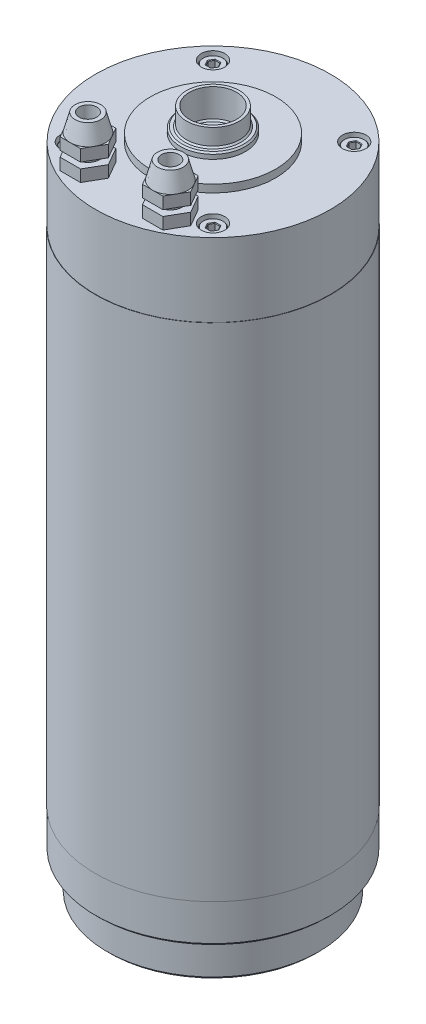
from build123d import *

# Parameters (mm, degrees)
SKIZZE2_R                                 = 4
SCHNITT_LINEAR_AUSTRAGEN1_DEPTH           = 6
SKIZZE3_R                                 = 3.5
AUFSATZ_LINEAR_AUSTRAGEN1_DEPTH           = 5
FASE1_SIZE                                = 0.2
FASE2_SIZE                                = 0.2
FASE3_SIZE                                = 0.2
FASE4_SIZE                                = 0.2
SKIZZE5_R                                 = 11
AUFSATZ_LINEAR_AUSTRAGEN2_DEPTH           = 8
SKIZZE6_R                                 = 14.478769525
SKIZZE6_R_2                               = 9
SCHNITT_LINEAR_AUSTRAGEN2_DEPTH           = 6
SKIZZE7_R                                 = 8
SCHNITT_LINEAR_AUSTRAGEN3_DEPTH           = 10
FASE5_SIZE                                = 0.5
AUFSATZ_LINEAR_AUSTRAGEN3_DEPTH           = 4
SKIZZE9_R                                 = 4
AUFSATZ_LINEAR_AUSTRAGEN4_DEPTH           = 2
AUFSATZ_LINEAR_AUSTRAGEN5_DEPTH           = 4
SKIZZE12_R                                = 6
AUFSATZ_LINEAR_AUSTRAGEN6_DEPTH           = 6
AUFSATZ_LINEAR_AUSTRAGEN6_DRAFT           = 15
AUFSATZ_LINEAR_AUSTRAGEN6_PROFILE_2_DEPTH = 6
AUFSATZ_LINEAR_AUSTRAGEN6_PROFILE_2_DRAFT = 15
SKIZZE13_R                                = 3
SCHNITT_LINEAR_AUSTRAGEN4_DEPTH           = 16


with BuildPart() as part:
    # Skizze1 → Rotation1 (revolve)
    with BuildSketch(Plane.XY, mode=Mode.PRIVATE) as rotation1_sk:
        Polygon((-15, 0), (-35, 0), (-36, 1), (-36, 12.6), (-38.9, 12.6), (-39.9, 13.6), (-39.9, 26), (-40, 26), (-40, 196.4), (-39.9, 196.4), (-39.9, 221.4), (-21.3, 221.4), (-21.3, 224), (0, 224), (0, 30), (-15, 30), align=None)
    revolve(rotation1_sk.sketch.rotate(Axis((0, 30, 0), (0, 1, 0)), 180), axis=Axis((0, 30, 0), (0, 1, 0)))

    # Skizze2 → Schnitt-Linear austragen1 (cut)
    with BuildSketch(Plane(origin=(0, 221.4, 0), x_dir=(1, 0, 0), z_dir=(0, 1, 0))):
        with Locations(Location((24, -24, 0), (0, 0, 180))):
            Circle(SKIZZE2_R)
        with Locations(Location((-24, -24, 0), (0, 0, 180))):
            Circle(SKIZZE2_R)
        with Locations(Location((-24, 24, 0), (0, 0, 180))):
            Circle(SKIZZE2_R)
        with Locations(Location((24, 24, 0), (0, 0, 180))):
            Circle(SKIZZE2_R)
    extrude(amount=-SCHNITT_LINEAR_AUSTRAGEN1_DEPTH, mode=Mode.SUBTRACT)

    # Skizze3 → Aufsatz-Linear austragen1 (add)
    # profile 1 of 4: a face of its own
    with BuildSketch(Plane(origin=(0, 215.4, 0), x_dir=(1, 0, 0), z_dir=(0, 1, 0))):
        with Locations(Location((24, -24, 0), (0, 0, 180))):
            Circle(SKIZZE3_R)
        Polygon((22.267949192, -24), (23.133974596, -25.5), (24.866025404, -25.5), (25.732050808, -24), (24.866025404, -22.5), (23.133974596, -22.5), align=None, mode=Mode.SUBTRACT)
    # profile 2 of 4: a face of its own
    with BuildSketch(Plane(origin=(0, 215.4, 0), x_dir=(1, 0, 0), z_dir=(0, 1, 0))):
        with Locations(Location((-24, -24, 0), (0, 0, 180))):
            Circle(SKIZZE3_R)
        Polygon((-25.732050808, -24), (-24.866025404, -25.5), (-23.133974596, -25.5), (-22.267949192, -24), (-23.133974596, -22.5), (-24.866025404, -22.5), align=None, mode=Mode.SUBTRACT)
    # profile 3 of 4: a face of its own
    with BuildSketch(Plane(origin=(0, 215.4, 0), x_dir=(1, 0, 0), z_dir=(0, 1, 0))):
        with Locations(Location((-24, 24, 0), (0, 0, 180))):
            Circle(SKIZZE3_R)
        Polygon((-25.732050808, 24), (-24.866025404, 22.5), (-23.133974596, 22.5), (-22.267949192, 24), (-23.133974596, 25.5), (-24.866025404, 25.5), align=None, mode=Mode.SUBTRACT)
    # profile 4 of 4: a face of its own
    with BuildSketch(Plane(origin=(0, 215.4, 0), x_dir=(1, 0, 0), z_dir=(0, 1, 0))):
        with Locations(Location((24, 24, 0), (0, 0, 180))):
            Circle(SKIZZE3_R)
        Polygon((22.267949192, 24), (23.133974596, 22.5), (24.866025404, 22.5), (25.732050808, 24), (24.866025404, 25.5), (23.133974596, 25.5), align=None, mode=Mode.SUBTRACT)
    extrude(amount=AUFSATZ_LINEAR_AUSTRAGEN1_DEPTH)

    # Fase1
    fase1_edges = [part.edges().sort_by_distance(p)[0] for p in [
        (27.5, 220.4, 24),
        (22.700961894, 220.4, 23.25),
        (22.700961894, 220.4, 24.75),
        (24, 220.4, 25.5),
        (25.299038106, 220.4, 24.75),
        (25.299038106, 220.4, 23.25),
        (24, 220.4, 22.5),
    ]]
    chamfer(fase1_edges, length=FASE1_SIZE)

    # Fase2
    fase2_edges = [part.edges().sort_by_distance(p)[0] for p in [
        (-20.5, 220.4, 24),
        (-25.299038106, 220.4, 23.25),
        (-25.299038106, 220.4, 24.75),
        (-24, 220.4, 25.5),
        (-22.700961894, 220.4, 24.75),
        (-22.700961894, 220.4, 23.25),
        (-24, 220.4, 22.5),
    ]]
    chamfer(fase2_edges, length=FASE2_SIZE)

    # Fase3
    fase3_edges = [part.edges().sort_by_distance(p)[0] for p in [
        (-20.5, 220.4, -24),
        (-25.299038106, 220.4, -24.75),
        (-25.299038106, 220.4, -23.25),
        (-24, 220.4, -22.5),
        (-22.700961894, 220.4, -23.25),
        (-22.700961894, 220.4, -24.75),
        (-24, 220.4, -25.5),
    ]]
    chamfer(fase3_edges, length=FASE3_SIZE)

    # Fase4
    fase4_edges = [part.edges().sort_by_distance(p)[0] for p in [
        (27.5, 220.4, -24),
        (22.700961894, 220.4, -24.75),
        (22.700961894, 220.4, -23.25),
        (24, 220.4, -22.5),
        (25.299038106, 220.4, -23.25),
        (25.299038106, 220.4, -24.75),
        (24, 220.4, -25.5),
    ]]
    chamfer(fase4_edges, length=FASE4_SIZE)

    # Skizze5 → Aufsatz-Linear austragen2 (add)
    with BuildSketch(Plane(origin=(0, 224, 0), x_dir=(1, 0, 0), z_dir=(0, 1, 0))):
        Circle(SKIZZE5_R)
    extrude(amount=AUFSATZ_LINEAR_AUSTRAGEN2_DEPTH)

    # Skizze6 → Schnitt-Linear austragen2 (cut)
    with BuildSketch(Plane(origin=(0, 232, 0), x_dir=(1, 0, 0), z_dir=(0, 1, 0))):
        Circle(SKIZZE6_R)
        with Locations(Location((0, 0, 0), (0, 0, 180))):
            Circle(SKIZZE6_R_2, mode=Mode.SUBTRACT)
    extrude(amount=-SCHNITT_LINEAR_AUSTRAGEN2_DEPTH, mode=Mode.SUBTRACT)

    # Skizze7 → Schnitt-Linear austragen3 (cut)
    with BuildSketch(Plane(origin=(0, 232, 0), x_dir=(1, 0, 0), z_dir=(0, 1, 0))):
        with Locations(Location((0, 0, 0), (0, 0, 180))):
            Circle(SKIZZE7_R)
    extrude(amount=-SCHNITT_LINEAR_AUSTRAGEN3_DEPTH, mode=Mode.SUBTRACT)

    # Fase5
    fase5_edges = [part.edges().sort_by_distance(p)[0] for p in [
        (9, 226, 0),
        (-11, 226, 0),
        (8, 222, 0),
    ]]
    chamfer(fase5_edges, length=FASE5_SIZE)

    # Skizze8 → Aufsatz-Linear austragen3 (add)
    with BuildSketch(Plane(origin=(0, 221.4, 0), x_dir=(1, 0, 0), z_dir=(0, 1, 0))):
        Polygon((10.535898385, -22.5), (7.07179677, -28.5), (10.535898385, -34.5), (17.464101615, -34.5), (20.92820323, -28.5), (17.464101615, -22.5), align=None)
        Polygon((-10.535898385, -22.5), (-17.464101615, -22.5), (-20.92820323, -28.5), (-17.464101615, -34.5), (-10.535898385, -34.5), (-7.07179677, -28.5), align=None)
    extrude(amount=AUFSATZ_LINEAR_AUSTRAGEN3_DEPTH)

    # Skizze9 → Aufsatz-Linear austragen4 (add)
    with BuildSketch(Plane(origin=(0, 225.4, 0), x_dir=(1, 0, 0), z_dir=(0, 1, 0))):
        with Locations(Location((14, -28.5, 0), (0, 0, 270))):
            Circle(SKIZZE9_R)
        with Locations(Location((-14, -28.5, 0), (0, 0, 270))):
            Circle(SKIZZE9_R)
    extrude(amount=AUFSATZ_LINEAR_AUSTRAGEN4_DEPTH)

    # Skizze10 → Aufsatz-Linear austragen5 (add)
    with BuildSketch(Plane(origin=(0, 227.4, 0), x_dir=(1, 0, 0), z_dir=(0, 1, 0))):
        Polygon((7.07179677, -28.5), (10.535898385, -34.5), (17.464101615, -34.5), (20.92820323, -28.5), (17.464101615, -22.5), (10.535898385, -22.5), align=None)
        Polygon((-20.92820323, -28.5), (-17.464101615, -34.5), (-10.535898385, -34.5), (-7.07179677, -28.5), (-10.535898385, -22.5), (-17.464101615, -22.5), align=None)
    extrude(amount=AUFSATZ_LINEAR_AUSTRAGEN5_DEPTH)


with BuildPart() as aufsatz_linear_austragen6_tool:
    # Skizze12 → Aufsatz-Linear austragen6 (with draft: the straight prism first)
    with BuildSketch(Plane(origin=(0, 231.4, 0), x_dir=(1, 0, 0), z_dir=(0, 1, 0))):
        with Locations((14, -28.5)):
            Circle(SKIZZE12_R)
    extrude(amount=AUFSATZ_LINEAR_AUSTRAGEN6_DEPTH)
    # Aufsatz-Linear austragen6: the draft: its side faces are tilted about the plane it starts from
    aufsatz_linear_austragen6_sides = [aufsatz_linear_austragen6_tool.faces().sort_by_distance(p)[0] for p in [
        (8, 234.4, 28.5),
    ]]
    draft(aufsatz_linear_austragen6_sides, Plane(origin=(0, 231.4, 0), x_dir=(1, 0, 0), z_dir=(0, 1, 0)), AUFSATZ_LINEAR_AUSTRAGEN6_DRAFT)


with BuildPart() as part_1:
    add(part.part)

    # Aufsatz-Linear austragen6: add aufsatz_linear_austragen6_tool
    add(aufsatz_linear_austragen6_tool.part)


with BuildPart() as aufsatz_linear_austragen6_profile_2_tool:
    # Skizze12 → Aufsatz-Linear austragen6 profile 2 (with draft: the straight prism first)
    with BuildSketch(Plane(origin=(0, 231.4, 0), x_dir=(1, 0, 0), z_dir=(0, 1, 0))):
        with Locations((-14, -28.5)):
            Circle(SKIZZE12_R)
    extrude(amount=AUFSATZ_LINEAR_AUSTRAGEN6_PROFILE_2_DEPTH)
    # Aufsatz-Linear austragen6 profile 2: the draft: its side faces are tilted about the plane it starts from
    aufsatz_linear_austragen6_profile_2_sides = [aufsatz_linear_austragen6_profile_2_tool.faces().sort_by_distance(p)[0] for p in [
        (-20, 234.4, 28.5),
    ]]
    draft(aufsatz_linear_austragen6_profile_2_sides, Plane(origin=(0, 231.4, 0), x_dir=(1, 0, 0), z_dir=(0, 1, 0)), AUFSATZ_LINEAR_AUSTRAGEN6_PROFILE_2_DRAFT)


with BuildPart() as part_2:
    add(part_1.part)

    # Aufsatz-Linear austragen6 profile 2: add aufsatz_linear_austragen6_profile_2_tool
    add(aufsatz_linear_austragen6_profile_2_tool.part)

    # Skizze13 → Schnitt-Linear austragen4 (cut)
    with BuildSketch(Plane(origin=(0, 237.4, 0), x_dir=(1, 0, 0), z_dir=(0, 1, 0))):
        with Locations(Location((14, -28.5, 0), (0, 0, 270))):
            Circle(SKIZZE13_R)
        with Locations(Location((-14, -28.5, 0), (0, 0, 270))):
            Circle(SKIZZE13_R)
    extrude(amount=-SCHNITT_LINEAR_AUSTRAGEN4_DEPTH, mode=Mode.SUBTRACT)


solid = part_2.part
